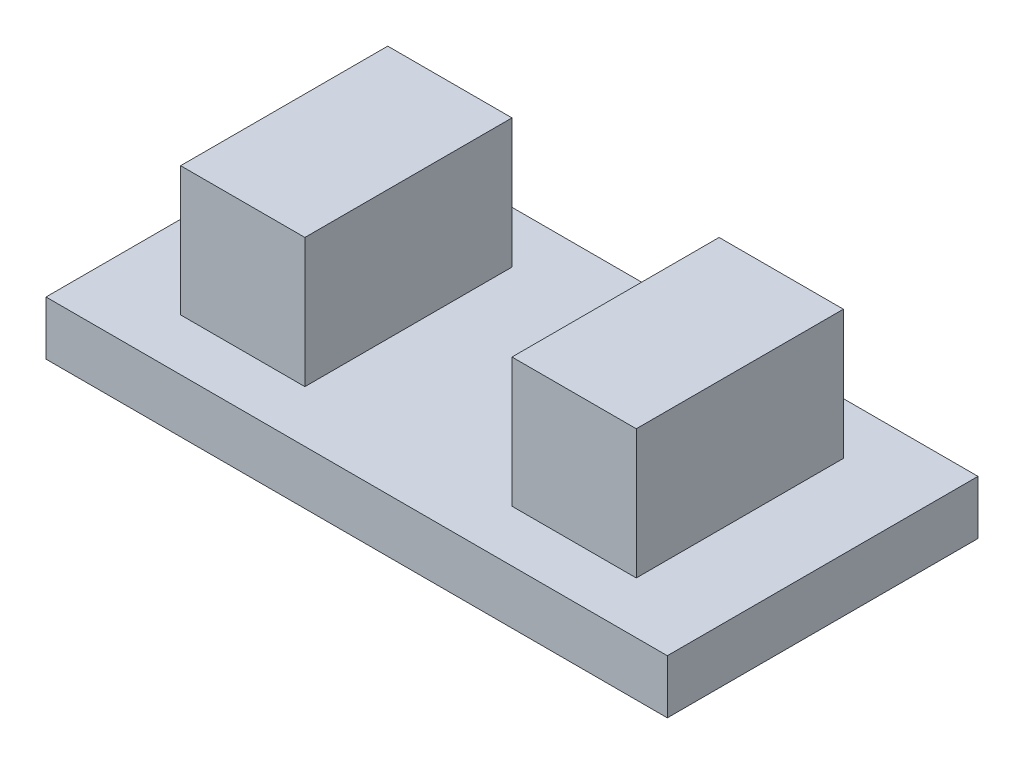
ISO-10303-21;
HEADER;
FILE_DESCRIPTION(('STEP AP214'),'2;1');
FILE_NAME('part.step','',(''),(''),'','','');
FILE_SCHEMA(('AUTOMOTIVE_DESIGN { 1 0 10303 214 1 1 1 1 }'));
ENDSEC;
DATA;
#1=APPLICATION_CONTEXT('core data for automotive mechanical design processes');
#2=APPLICATION_PROTOCOL_DEFINITION('international standard','automotive_design',2000,#1);
#3=PRODUCT_CONTEXT('',#1,'mechanical');
#4=PRODUCT('Part','Part','',(#3));
#5=PRODUCT_RELATED_PRODUCT_CATEGORY('part','',(#4));
#6=PRODUCT_DEFINITION_FORMATION('','',#4);
#7=PRODUCT_DEFINITION_CONTEXT('part definition',#1,'design');
#8=PRODUCT_DEFINITION('design','',#6,#7);
#9=PRODUCT_DEFINITION_SHAPE('','',#8);
#10=(LENGTH_UNIT() NAMED_UNIT(*) SI_UNIT(.MILLI.,.METRE.));
#11=(NAMED_UNIT(*) PLANE_ANGLE_UNIT() SI_UNIT($,.RADIAN.));
#12=(NAMED_UNIT(*) SI_UNIT($,.STERADIAN.) SOLID_ANGLE_UNIT());
#13=UNCERTAINTY_MEASURE_WITH_UNIT(LENGTH_MEASURE(1.E-05),#10,'distance_accuracy_value','');
#14=(GEOMETRIC_REPRESENTATION_CONTEXT(3) GLOBAL_UNCERTAINTY_ASSIGNED_CONTEXT((#13)) GLOBAL_UNIT_ASSIGNED_CONTEXT((#10,
#11,#12)) REPRESENTATION_CONTEXT('',''));
#15=CARTESIAN_POINT('',(0.,0.,0.));
#16=DIRECTION('',(0.,0.,1.));
#17=DIRECTION('',(1.,0.,0.));
#18=AXIS2_PLACEMENT_3D('',#15,#16,#17);
#19=CARTESIAN_POINT('',(55.,44.1991413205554,25.));
#20=DIRECTION('',(-1.,0.,0.));
#21=DIRECTION('',(0.,0.,-1.));
#22=AXIS2_PLACEMENT_3D('',#19,#20,#21);
#23=PLANE('',#22);
#24=DIRECTION('',(0.,0.,1.));
#25=VECTOR('',#24,1.);
#26=CARTESIAN_POINT('',(55.,13.,25.));
#27=LINE('',#26,#25);
#28=CARTESIAN_POINT('',(55.,13.,-25.));
#29=VERTEX_POINT('',#28);
#30=CARTESIAN_POINT('',(55.,13.,25.));
#31=VERTEX_POINT('',#30);
#32=EDGE_CURVE('E93',#29,#31,#27,.T.);
#33=ORIENTED_EDGE('',*,*,#32,.F.);
#34=DIRECTION('',(0.,-1.,0.));
#35=VECTOR('',#34,1.);
#36=CARTESIAN_POINT('',(55.,44.1991413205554,-25.));
#37=LINE('',#36,#35);
#38=CARTESIAN_POINT('',(55.,44.1991413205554,-25.));
#39=VERTEX_POINT('',#38);
#40=EDGE_CURVE('E112',#39,#29,#37,.T.);
#41=ORIENTED_EDGE('',*,*,#40,.F.);
#42=DIRECTION('',(0.,0.,1.));
#43=VECTOR('',#42,1.);
#44=CARTESIAN_POINT('',(55.,44.1991413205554,25.));
#45=LINE('',#44,#43);
#46=CARTESIAN_POINT('',(55.,44.1991413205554,25.));
#47=VERTEX_POINT('',#46);
#48=EDGE_CURVE('E98',#39,#47,#45,.T.);
#49=ORIENTED_EDGE('',*,*,#48,.T.);
#50=DIRECTION('',(0.,-1.,0.));
#51=VECTOR('',#50,1.);
#52=CARTESIAN_POINT('',(55.,44.1991413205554,25.));
#53=LINE('',#52,#51);
#54=EDGE_CURVE('E12',#47,#31,#53,.T.);
#55=ORIENTED_EDGE('',*,*,#54,.T.);
#56=EDGE_LOOP('',(#33,#41,#49,#55));
#57=FACE_BOUND('',#56,.T.);
#58=ADVANCED_FACE('F45',(#57),#23,.F.);
#59=CARTESIAN_POINT('',(55.,44.1991413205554,25.));
#60=DIRECTION('',(0.,0.,-1.));
#61=DIRECTION('',(1.,0.,0.));
#62=AXIS2_PLACEMENT_3D('',#59,#60,#61);
#63=PLANE('',#62);
#64=DIRECTION('',(-1.,0.,0.));
#65=VECTOR('',#64,1.);
#66=CARTESIAN_POINT('',(55.,13.,25.));
#67=LINE('',#66,#65);
#68=CARTESIAN_POINT('',(25.,13.,25.));
#69=VERTEX_POINT('',#68);
#70=EDGE_CURVE('E84',#31,#69,#67,.T.);
#71=ORIENTED_EDGE('',*,*,#70,.F.);
#72=ORIENTED_EDGE('',*,*,#54,.F.);
#73=DIRECTION('',(-1.,0.,0.));
#74=VECTOR('',#73,1.);
#75=CARTESIAN_POINT('',(55.,44.1991413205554,25.));
#76=LINE('',#75,#74);
#77=CARTESIAN_POINT('',(25.,44.1991413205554,25.));
#78=VERTEX_POINT('',#77);
#79=EDGE_CURVE('E106',#47,#78,#76,.T.);
#80=ORIENTED_EDGE('',*,*,#79,.T.);
#81=DIRECTION('',(0.,-1.,0.));
#82=VECTOR('',#81,1.);
#83=CARTESIAN_POINT('',(25.,44.1991413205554,25.));
#84=LINE('',#83,#82);
#85=EDGE_CURVE('E52',#78,#69,#84,.T.);
#86=ORIENTED_EDGE('',*,*,#85,.T.);
#87=EDGE_LOOP('',(#71,#72,#80,#86));
#88=FACE_BOUND('',#87,.T.);
#89=ADVANCED_FACE('F85',(#88),#63,.F.);
#90=CARTESIAN_POINT('',(25.,44.1991413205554,25.));
#91=DIRECTION('',(1.,0.,0.));
#92=DIRECTION('',(0.,0.,1.));
#93=AXIS2_PLACEMENT_3D('',#90,#91,#92);
#94=PLANE('',#93);
#95=DIRECTION('',(0.,0.,-1.));
#96=VECTOR('',#95,1.);
#97=CARTESIAN_POINT('',(25.,13.,25.));
#98=LINE('',#97,#96);
#99=CARTESIAN_POINT('',(25.,13.,-25.));
#100=VERTEX_POINT('',#99);
#101=EDGE_CURVE('E92',#69,#100,#98,.T.);
#102=ORIENTED_EDGE('',*,*,#101,.F.);
#103=ORIENTED_EDGE('',*,*,#85,.F.);
#104=DIRECTION('',(0.,0.,-1.));
#105=VECTOR('',#104,1.);
#106=CARTESIAN_POINT('',(25.,44.1991413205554,25.));
#107=LINE('',#106,#105);
#108=CARTESIAN_POINT('',(25.,44.1991413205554,-25.));
#109=VERTEX_POINT('',#108);
#110=EDGE_CURVE('E108',#78,#109,#107,.T.);
#111=ORIENTED_EDGE('',*,*,#110,.T.);
#112=DIRECTION('',(0.,-1.,0.));
#113=VECTOR('',#112,1.);
#114=CARTESIAN_POINT('',(25.,44.1991413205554,-25.));
#115=LINE('',#114,#113);
#116=EDGE_CURVE('E114',#109,#100,#115,.T.);
#117=ORIENTED_EDGE('',*,*,#116,.T.);
#118=EDGE_LOOP('',(#102,#103,#111,#117));
#119=FACE_BOUND('',#118,.T.);
#120=ADVANCED_FACE('F117',(#119),#94,.F.);
#121=CARTESIAN_POINT('',(55.,44.1991413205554,-25.));
#122=DIRECTION('',(0.,0.,1.));
#123=DIRECTION('',(-1.,0.,0.));
#124=AXIS2_PLACEMENT_3D('',#121,#122,#123);
#125=PLANE('',#124);
#126=DIRECTION('',(1.,0.,0.));
#127=VECTOR('',#126,1.);
#128=CARTESIAN_POINT('',(55.,13.,-25.));
#129=LINE('',#128,#127);
#130=EDGE_CURVE('E100',#100,#29,#129,.T.);
#131=ORIENTED_EDGE('',*,*,#130,.F.);
#132=ORIENTED_EDGE('',*,*,#116,.F.);
#133=DIRECTION('',(1.,0.,0.));
#134=VECTOR('',#133,1.);
#135=CARTESIAN_POINT('',(55.,44.1991413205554,-25.));
#136=LINE('',#135,#134);
#137=EDGE_CURVE('E59',#109,#39,#136,.T.);
#138=ORIENTED_EDGE('',*,*,#137,.T.);
#139=ORIENTED_EDGE('',*,*,#40,.T.);
#140=EDGE_LOOP('',(#131,#132,#138,#139));
#141=FACE_BOUND('',#140,.T.);
#142=ADVANCED_FACE('F118',(#141),#125,.F.);
#143=CARTESIAN_POINT('',(55.,44.1991413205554,-25.));
#144=DIRECTION('',(0.,-1.,0.));
#145=DIRECTION('',(0.,0.,-1.));
#146=AXIS2_PLACEMENT_3D('',#143,#144,#145);
#147=PLANE('',#146);
#148=ORIENTED_EDGE('',*,*,#48,.F.);
#149=ORIENTED_EDGE('',*,*,#137,.F.);
#150=ORIENTED_EDGE('',*,*,#110,.F.);
#151=ORIENTED_EDGE('',*,*,#79,.F.);
#152=EDGE_LOOP('',(#148,#149,#150,#151));
#153=FACE_BOUND('',#152,.T.);
#154=ADVANCED_FACE('F120',(#153),#147,.F.);
#155=CARTESIAN_POINT('',(55.,13.,-25.));
#156=DIRECTION('',(0.,-1.,0.));
#157=DIRECTION('',(0.,0.,-1.));
#158=AXIS2_PLACEMENT_3D('',#155,#156,#157);
#159=PLANE('',#158);
#160=ORIENTED_EDGE('',*,*,#32,.T.);
#161=ORIENTED_EDGE('',*,*,#70,.T.);
#162=ORIENTED_EDGE('',*,*,#101,.T.);
#163=ORIENTED_EDGE('',*,*,#130,.T.);
#164=EDGE_LOOP('',(#160,#161,#162,#163));
#165=FACE_BOUND('',#164,.T.);
#166=ADVANCED_FACE('F99',(#165),#159,.T.);
#167=CLOSED_SHELL('',(#58,#89,#120,#142,#154,#166));
#168=MANIFOLD_SOLID_BREP('B2',#167);
#169=CARTESIAN_POINT('',(-55.,44.1991413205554,25.));
#170=DIRECTION('',(1.,0.,0.));
#171=DIRECTION('',(0.,0.,-1.));
#172=AXIS2_PLACEMENT_3D('',#169,#170,#171);
#173=PLANE('',#172);
#174=DIRECTION('',(0.,0.,1.));
#175=VECTOR('',#174,1.);
#176=CARTESIAN_POINT('',(-55.,13.,25.));
#177=LINE('',#176,#175);
#178=CARTESIAN_POINT('',(-55.,13.,-25.));
#179=VERTEX_POINT('',#178);
#180=CARTESIAN_POINT('',(-55.,13.,25.));
#181=VERTEX_POINT('',#180);
#182=EDGE_CURVE('E221',#179,#181,#177,.T.);
#183=ORIENTED_EDGE('',*,*,#182,.T.);
#184=DIRECTION('',(0.,-1.,0.));
#185=VECTOR('',#184,1.);
#186=CARTESIAN_POINT('',(-55.,44.1991413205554,25.));
#187=LINE('',#186,#185);
#188=CARTESIAN_POINT('',(-55.,44.1991413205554,25.));
#189=VERTEX_POINT('',#188);
#190=EDGE_CURVE('E43',#189,#181,#187,.T.);
#191=ORIENTED_EDGE('',*,*,#190,.F.);
#192=DIRECTION('',(0.,0.,1.));
#193=VECTOR('',#192,1.);
#194=CARTESIAN_POINT('',(-55.,44.1991413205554,25.));
#195=LINE('',#194,#193);
#196=CARTESIAN_POINT('',(-55.,44.1991413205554,-25.));
#197=VERTEX_POINT('',#196);
#198=EDGE_CURVE('E239',#197,#189,#195,.T.);
#199=ORIENTED_EDGE('',*,*,#198,.F.);
#200=DIRECTION('',(0.,-1.,0.));
#201=VECTOR('',#200,1.);
#202=CARTESIAN_POINT('',(-55.,44.1991413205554,-25.));
#203=LINE('',#202,#201);
#204=EDGE_CURVE('E233',#197,#179,#203,.T.);
#205=ORIENTED_EDGE('',*,*,#204,.T.);
#206=EDGE_LOOP('',(#183,#191,#199,#205));
#207=FACE_BOUND('',#206,.T.);
#208=ADVANCED_FACE('F177',(#207),#173,.F.);
#209=CARTESIAN_POINT('',(-55.,44.1991413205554,25.));
#210=DIRECTION('',(0.,0.,-1.));
#211=DIRECTION('',(-1.,0.,0.));
#212=AXIS2_PLACEMENT_3D('',#209,#210,#211);
#213=PLANE('',#212);
#214=DIRECTION('',(1.,0.,0.));
#215=VECTOR('',#214,1.);
#216=CARTESIAN_POINT('',(-55.,13.,25.));
#217=LINE('',#216,#215);
#218=CARTESIAN_POINT('',(-25.,13.,25.));
#219=VERTEX_POINT('',#218);
#220=EDGE_CURVE('E217',#181,#219,#217,.T.);
#221=ORIENTED_EDGE('',*,*,#220,.T.);
#222=DIRECTION('',(0.,-1.,0.));
#223=VECTOR('',#222,1.);
#224=CARTESIAN_POINT('',(-25.,44.1991413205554,25.));
#225=LINE('',#224,#223);
#226=CARTESIAN_POINT('',(-25.,44.1991413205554,25.));
#227=VERTEX_POINT('',#226);
#228=EDGE_CURVE('E184',#227,#219,#225,.T.);
#229=ORIENTED_EDGE('',*,*,#228,.F.);
#230=DIRECTION('',(1.,0.,0.));
#231=VECTOR('',#230,1.);
#232=CARTESIAN_POINT('',(-55.,44.1991413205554,25.));
#233=LINE('',#232,#231);
#234=EDGE_CURVE('E229',#189,#227,#233,.T.);
#235=ORIENTED_EDGE('',*,*,#234,.F.);
#236=ORIENTED_EDGE('',*,*,#190,.T.);
#237=EDGE_LOOP('',(#221,#229,#235,#236));
#238=FACE_BOUND('',#237,.T.);
#239=ADVANCED_FACE('F228',(#238),#213,.F.);
#240=CARTESIAN_POINT('',(-25.,44.1991413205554,25.));
#241=DIRECTION('',(-1.,0.,0.));
#242=DIRECTION('',(0.,0.,1.));
#243=AXIS2_PLACEMENT_3D('',#240,#241,#242);
#244=PLANE('',#243);
#245=DIRECTION('',(0.,0.,-1.));
#246=VECTOR('',#245,1.);
#247=CARTESIAN_POINT('',(-25.,13.,25.));
#248=LINE('',#247,#246);
#249=CARTESIAN_POINT('',(-25.,13.,-25.));
#250=VERTEX_POINT('',#249);
#251=EDGE_CURVE('E222',#219,#250,#248,.T.);
#252=ORIENTED_EDGE('',*,*,#251,.T.);
#253=DIRECTION('',(0.,-1.,0.));
#254=VECTOR('',#253,1.);
#255=CARTESIAN_POINT('',(-25.,44.1991413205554,-25.));
#256=LINE('',#255,#254);
#257=CARTESIAN_POINT('',(-25.,44.1991413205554,-25.));
#258=VERTEX_POINT('',#257);
#259=EDGE_CURVE('E245',#258,#250,#256,.T.);
#260=ORIENTED_EDGE('',*,*,#259,.F.);
#261=DIRECTION('',(0.,0.,-1.));
#262=VECTOR('',#261,1.);
#263=CARTESIAN_POINT('',(-25.,44.1991413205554,25.));
#264=LINE('',#263,#262);
#265=EDGE_CURVE('E196',#227,#258,#264,.T.);
#266=ORIENTED_EDGE('',*,*,#265,.F.);
#267=ORIENTED_EDGE('',*,*,#228,.T.);
#268=EDGE_LOOP('',(#252,#260,#266,#267));
#269=FACE_BOUND('',#268,.T.);
#270=ADVANCED_FACE('F248',(#269),#244,.F.);
#271=CARTESIAN_POINT('',(-55.,44.1991413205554,-25.));
#272=DIRECTION('',(0.,0.,1.));
#273=DIRECTION('',(1.,0.,0.));
#274=AXIS2_PLACEMENT_3D('',#271,#272,#273);
#275=PLANE('',#274);
#276=DIRECTION('',(-1.,0.,0.));
#277=VECTOR('',#276,1.);
#278=CARTESIAN_POINT('',(-55.,13.,-25.));
#279=LINE('',#278,#277);
#280=EDGE_CURVE('E237',#250,#179,#279,.T.);
#281=ORIENTED_EDGE('',*,*,#280,.T.);
#282=ORIENTED_EDGE('',*,*,#204,.F.);
#283=DIRECTION('',(-1.,0.,0.));
#284=VECTOR('',#283,1.);
#285=CARTESIAN_POINT('',(-55.,44.1991413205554,-25.));
#286=LINE('',#285,#284);
#287=EDGE_CURVE('E191',#258,#197,#286,.T.);
#288=ORIENTED_EDGE('',*,*,#287,.F.);
#289=ORIENTED_EDGE('',*,*,#259,.T.);
#290=EDGE_LOOP('',(#281,#282,#288,#289));
#291=FACE_BOUND('',#290,.T.);
#292=ADVANCED_FACE('F250',(#291),#275,.F.);
#293=CARTESIAN_POINT('',(-55.,44.1991413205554,-25.));
#294=DIRECTION('',(0.,-1.,0.));
#295=DIRECTION('',(0.,0.,-1.));
#296=AXIS2_PLACEMENT_3D('',#293,#294,#295);
#297=PLANE('',#296);
#298=ORIENTED_EDGE('',*,*,#198,.T.);
#299=ORIENTED_EDGE('',*,*,#234,.T.);
#300=ORIENTED_EDGE('',*,*,#265,.T.);
#301=ORIENTED_EDGE('',*,*,#287,.T.);
#302=EDGE_LOOP('',(#298,#299,#300,#301));
#303=FACE_BOUND('',#302,.T.);
#304=ADVANCED_FACE('F251',(#303),#297,.F.);
#305=CARTESIAN_POINT('',(-55.,13.,-25.));
#306=DIRECTION('',(0.,-1.,0.));
#307=DIRECTION('',(0.,0.,-1.));
#308=AXIS2_PLACEMENT_3D('',#305,#306,#307);
#309=PLANE('',#308);
#310=ORIENTED_EDGE('',*,*,#182,.F.);
#311=ORIENTED_EDGE('',*,*,#280,.F.);
#312=ORIENTED_EDGE('',*,*,#251,.F.);
#313=ORIENTED_EDGE('',*,*,#220,.F.);
#314=EDGE_LOOP('',(#310,#311,#312,#313));
#315=FACE_BOUND('',#314,.T.);
#316=ADVANCED_FACE('F218',(#315),#309,.T.);
#317=CLOSED_SHELL('',(#208,#239,#270,#292,#304,#316));
#318=MANIFOLD_SOLID_BREP('B6',#317);
#319=CARTESIAN_POINT('',(-75.,13.,-37.5));
#320=DIRECTION('',(1.,0.,0.));
#321=DIRECTION('',(0.,0.,-1.));
#322=AXIS2_PLACEMENT_3D('',#319,#320,#321);
#323=PLANE('',#322);
#324=DIRECTION('',(0.,0.,1.));
#325=VECTOR('',#324,1.);
#326=CARTESIAN_POINT('',(-75.,0.,-37.5));
#327=LINE('',#326,#325);
#328=CARTESIAN_POINT('',(-75.,0.,-37.5));
#329=VERTEX_POINT('',#328);
#330=CARTESIAN_POINT('',(-75.,0.,37.5));
#331=VERTEX_POINT('',#330);
#332=EDGE_CURVE('E354',#329,#331,#327,.T.);
#333=ORIENTED_EDGE('',*,*,#332,.T.);
#334=DIRECTION('',(0.,-1.,0.));
#335=VECTOR('',#334,1.);
#336=CARTESIAN_POINT('',(-75.,13.,37.5));
#337=LINE('',#336,#335);
#338=CARTESIAN_POINT('',(-75.,13.,37.5));
#339=VERTEX_POINT('',#338);
#340=EDGE_CURVE('E175',#339,#331,#337,.T.);
#341=ORIENTED_EDGE('',*,*,#340,.F.);
#342=DIRECTION('',(0.,0.,1.));
#343=VECTOR('',#342,1.);
#344=CARTESIAN_POINT('',(-75.,13.,-37.5));
#345=LINE('',#344,#343);
#346=CARTESIAN_POINT('',(-75.,13.,-37.5));
#347=VERTEX_POINT('',#346);
#348=EDGE_CURVE('E372',#347,#339,#345,.T.);
#349=ORIENTED_EDGE('',*,*,#348,.F.);
#350=DIRECTION('',(0.,-1.,0.));
#351=VECTOR('',#350,1.);
#352=CARTESIAN_POINT('',(-75.,13.,-37.5));
#353=LINE('',#352,#351);
#354=EDGE_CURVE('E366',#347,#329,#353,.T.);
#355=ORIENTED_EDGE('',*,*,#354,.T.);
#356=EDGE_LOOP('',(#333,#341,#349,#355));
#357=FACE_BOUND('',#356,.T.);
#358=ADVANCED_FACE('F310',(#357),#323,.F.);
#359=CARTESIAN_POINT('',(-75.,13.,37.5));
#360=DIRECTION('',(0.,0.,-1.));
#361=DIRECTION('',(-1.,0.,0.));
#362=AXIS2_PLACEMENT_3D('',#359,#360,#361);
#363=PLANE('',#362);
#364=DIRECTION('',(1.,0.,0.));
#365=VECTOR('',#364,1.);
#366=CARTESIAN_POINT('',(-75.,0.,37.5));
#367=LINE('',#366,#365);
#368=CARTESIAN_POINT('',(75.,0.,37.5));
#369=VERTEX_POINT('',#368);
#370=EDGE_CURVE('E350',#331,#369,#367,.T.);
#371=ORIENTED_EDGE('',*,*,#370,.T.);
#372=DIRECTION('',(0.,-1.,0.));
#373=VECTOR('',#372,1.);
#374=CARTESIAN_POINT('',(75.,13.,37.5));
#375=LINE('',#374,#373);
#376=CARTESIAN_POINT('',(75.,13.,37.5));
#377=VERTEX_POINT('',#376);
#378=EDGE_CURVE('E317',#377,#369,#375,.T.);
#379=ORIENTED_EDGE('',*,*,#378,.F.);
#380=DIRECTION('',(1.,0.,0.));
#381=VECTOR('',#380,1.);
#382=CARTESIAN_POINT('',(-75.,13.,37.5));
#383=LINE('',#382,#381);
#384=EDGE_CURVE('E362',#339,#377,#383,.T.);
#385=ORIENTED_EDGE('',*,*,#384,.F.);
#386=ORIENTED_EDGE('',*,*,#340,.T.);
#387=EDGE_LOOP('',(#371,#379,#385,#386));
#388=FACE_BOUND('',#387,.T.);
#389=ADVANCED_FACE('F361',(#388),#363,.F.);
#390=CARTESIAN_POINT('',(75.,13.,-37.5));
#391=DIRECTION('',(-1.,0.,0.));
#392=DIRECTION('',(0.,0.,1.));
#393=AXIS2_PLACEMENT_3D('',#390,#391,#392);
#394=PLANE('',#393);
#395=DIRECTION('',(0.,0.,-1.));
#396=VECTOR('',#395,1.);
#397=CARTESIAN_POINT('',(75.,0.,-37.5));
#398=LINE('',#397,#396);
#399=CARTESIAN_POINT('',(75.,0.,-37.5));
#400=VERTEX_POINT('',#399);
#401=EDGE_CURVE('E355',#369,#400,#398,.T.);
#402=ORIENTED_EDGE('',*,*,#401,.T.);
#403=DIRECTION('',(0.,-1.,0.));
#404=VECTOR('',#403,1.);
#405=CARTESIAN_POINT('',(75.,13.,-37.5));
#406=LINE('',#405,#404);
#407=CARTESIAN_POINT('',(75.,13.,-37.5));
#408=VERTEX_POINT('',#407);
#409=EDGE_CURVE('E378',#408,#400,#406,.T.);
#410=ORIENTED_EDGE('',*,*,#409,.F.);
#411=DIRECTION('',(0.,0.,-1.));
#412=VECTOR('',#411,1.);
#413=CARTESIAN_POINT('',(75.,13.,-37.5));
#414=LINE('',#413,#412);
#415=EDGE_CURVE('E329',#377,#408,#414,.T.);
#416=ORIENTED_EDGE('',*,*,#415,.F.);
#417=ORIENTED_EDGE('',*,*,#378,.T.);
#418=EDGE_LOOP('',(#402,#410,#416,#417));
#419=FACE_BOUND('',#418,.T.);
#420=ADVANCED_FACE('F381',(#419),#394,.F.);
#421=CARTESIAN_POINT('',(-75.,13.,-37.5));
#422=DIRECTION('',(0.,0.,1.));
#423=DIRECTION('',(1.,0.,0.));
#424=AXIS2_PLACEMENT_3D('',#421,#422,#423);
#425=PLANE('',#424);
#426=DIRECTION('',(-1.,0.,0.));
#427=VECTOR('',#426,1.);
#428=CARTESIAN_POINT('',(-75.,0.,-37.5));
#429=LINE('',#428,#427);
#430=EDGE_CURVE('E370',#400,#329,#429,.T.);
#431=ORIENTED_EDGE('',*,*,#430,.T.);
#432=ORIENTED_EDGE('',*,*,#354,.F.);
#433=DIRECTION('',(-1.,0.,0.));
#434=VECTOR('',#433,1.);
#435=CARTESIAN_POINT('',(-75.,13.,-37.5));
#436=LINE('',#435,#434);
#437=EDGE_CURVE('E324',#408,#347,#436,.T.);
#438=ORIENTED_EDGE('',*,*,#437,.F.);
#439=ORIENTED_EDGE('',*,*,#409,.T.);
#440=EDGE_LOOP('',(#431,#432,#438,#439));
#441=FACE_BOUND('',#440,.T.);
#442=ADVANCED_FACE('F383',(#441),#425,.F.);
#443=CARTESIAN_POINT('',(-75.,13.,37.5));
#444=DIRECTION('',(0.,1.,0.));
#445=DIRECTION('',(0.,0.,1.));
#446=AXIS2_PLACEMENT_3D('',#443,#444,#445);
#447=PLANE('',#446);
#448=ORIENTED_EDGE('',*,*,#348,.T.);
#449=ORIENTED_EDGE('',*,*,#384,.T.);
#450=ORIENTED_EDGE('',*,*,#415,.T.);
#451=ORIENTED_EDGE('',*,*,#437,.T.);
#452=EDGE_LOOP('',(#448,#449,#450,#451));
#453=FACE_BOUND('',#452,.T.);
#454=ADVANCED_FACE('F384',(#453),#447,.T.);
#455=CARTESIAN_POINT('',(-75.,0.,37.5));
#456=DIRECTION('',(0.,1.,0.));
#457=DIRECTION('',(0.,0.,1.));
#458=AXIS2_PLACEMENT_3D('',#455,#456,#457);
#459=PLANE('',#458);
#460=ORIENTED_EDGE('',*,*,#332,.F.);
#461=ORIENTED_EDGE('',*,*,#430,.F.);
#462=ORIENTED_EDGE('',*,*,#401,.F.);
#463=ORIENTED_EDGE('',*,*,#370,.F.);
#464=EDGE_LOOP('',(#460,#461,#462,#463));
#465=FACE_BOUND('',#464,.T.);
#466=ADVANCED_FACE('F351',(#465),#459,.F.);
#467=CLOSED_SHELL('',(#358,#389,#420,#442,#454,#466));
#468=MANIFOLD_SOLID_BREP('B37',#467);
#469=ADVANCED_BREP_SHAPE_REPRESENTATION('',(#18,#168,#318,#468),#14);
#470=SHAPE_DEFINITION_REPRESENTATION(#9,#469);
ENDSEC;
END-ISO-10303-21;
